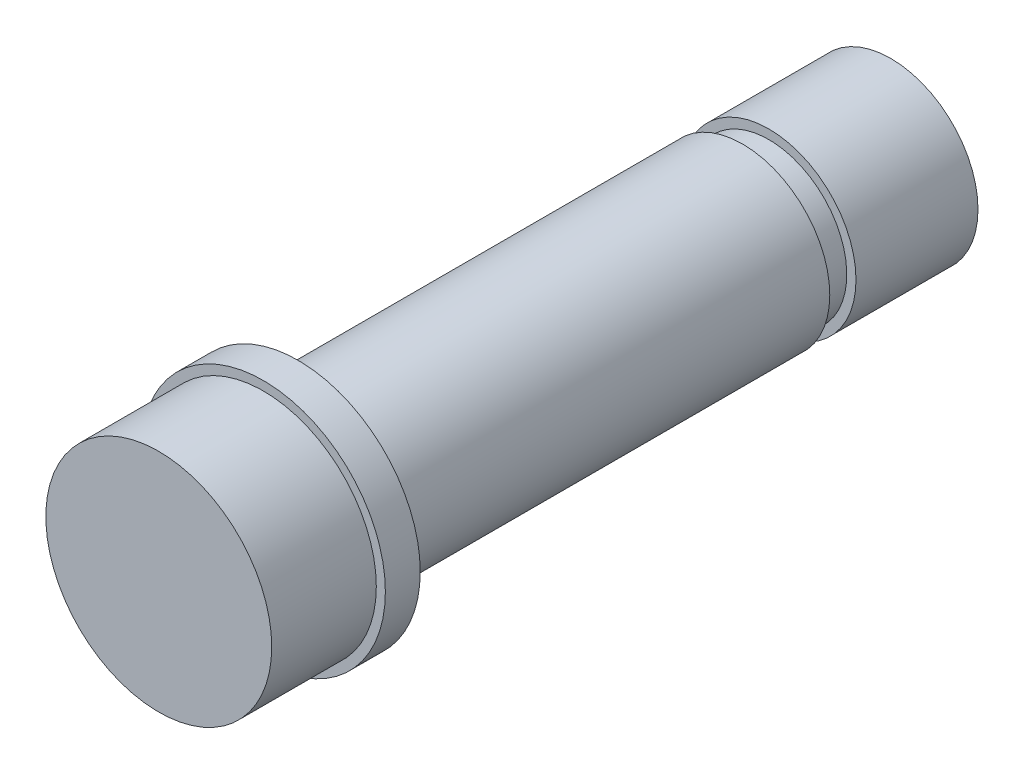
ISO-10303-21;
HEADER;
FILE_DESCRIPTION(('STEP AP214'),'2;1');
FILE_NAME('part.step','',(''),(''),'','','');
FILE_SCHEMA(('AUTOMOTIVE_DESIGN { 1 0 10303 214 1 1 1 1 }'));
ENDSEC;
DATA;
#1=APPLICATION_CONTEXT('core data for automotive mechanical design processes');
#2=APPLICATION_PROTOCOL_DEFINITION('international standard','automotive_design',2000,#1);
#3=PRODUCT_CONTEXT('',#1,'mechanical');
#4=PRODUCT('Part','Part','',(#3));
#5=PRODUCT_RELATED_PRODUCT_CATEGORY('part','',(#4));
#6=PRODUCT_DEFINITION_FORMATION('','',#4);
#7=PRODUCT_DEFINITION_CONTEXT('part definition',#1,'design');
#8=PRODUCT_DEFINITION('design','',#6,#7);
#9=PRODUCT_DEFINITION_SHAPE('','',#8);
#10=(LENGTH_UNIT() NAMED_UNIT(*) SI_UNIT(.MILLI.,.METRE.));
#11=(NAMED_UNIT(*) PLANE_ANGLE_UNIT() SI_UNIT($,.RADIAN.));
#12=(NAMED_UNIT(*) SI_UNIT($,.STERADIAN.) SOLID_ANGLE_UNIT());
#13=UNCERTAINTY_MEASURE_WITH_UNIT(LENGTH_MEASURE(1.E-05),#10,'distance_accuracy_value','');
#14=(GEOMETRIC_REPRESENTATION_CONTEXT(3) GLOBAL_UNCERTAINTY_ASSIGNED_CONTEXT((#13)) GLOBAL_UNIT_ASSIGNED_CONTEXT((#10,
#11,#12)) REPRESENTATION_CONTEXT('',''));
#15=CARTESIAN_POINT('',(0.,0.,0.));
#16=DIRECTION('',(0.,0.,1.));
#17=DIRECTION('',(1.,0.,0.));
#18=AXIS2_PLACEMENT_3D('',#15,#16,#17);
#19=CARTESIAN_POINT('',(0.,0.,0.));
#20=DIRECTION('',(0.,0.,1.));
#21=DIRECTION('',(1.,0.,0.));
#22=AXIS2_PLACEMENT_3D('',#19,#20,#21);
#23=CYLINDRICAL_SURFACE('',#22,7.9375);
#24=CARTESIAN_POINT('',(0.,0.,0.));
#25=DIRECTION('',(0.,0.,1.));
#26=DIRECTION('',(1.,0.,0.));
#27=AXIS2_PLACEMENT_3D('',#24,#25,#26);
#28=CIRCLE('',#27,7.93749999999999);
#29=CARTESIAN_POINT('',(7.93749999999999,0.,0.));
#30=VERTEX_POINT('',#29);
#31=EDGE_CURVE('E110',#30,#30,#28,.T.);
#32=ORIENTED_EDGE('',*,*,#31,.F.);
#33=EDGE_LOOP('',(#32));
#34=FACE_BOUND('',#33,.T.);
#35=CARTESIAN_POINT('',(0.,0.,-40.4749));
#36=DIRECTION('',(0.,0.,1.));
#37=DIRECTION('',(0.,-1.,0.));
#38=AXIS2_PLACEMENT_3D('',#35,#36,#37);
#39=CIRCLE('',#38,7.9375);
#40=CARTESIAN_POINT('',(0.,-7.9375,-40.4749));
#41=VERTEX_POINT('',#40);
#42=EDGE_CURVE('E88',#41,#41,#39,.T.);
#43=ORIENTED_EDGE('',*,*,#42,.T.);
#44=EDGE_LOOP('',(#43));
#45=FACE_BOUND('',#44,.T.);
#46=ADVANCED_FACE('F36',(#34,#45),#23,.T.);
#47=CARTESIAN_POINT('',(0.,7.93749999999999,0.));
#48=DIRECTION('',(0.,0.,1.));
#49=DIRECTION('',(1.,0.,0.));
#50=AXIS2_PLACEMENT_3D('',#47,#48,#49);
#51=PLANE('',#50);
#52=CARTESIAN_POINT('',(0.,0.,0.));
#53=DIRECTION('',(0.,0.,1.));
#54=DIRECTION('',(1.,0.,0.));
#55=AXIS2_PLACEMENT_3D('',#52,#53,#54);
#56=CIRCLE('',#55,11.1125);
#57=CARTESIAN_POINT('',(11.1125,0.,0.));
#58=VERTEX_POINT('',#57);
#59=EDGE_CURVE('E113',#58,#58,#56,.T.);
#60=ORIENTED_EDGE('',*,*,#59,.F.);
#61=EDGE_LOOP('',(#60));
#62=FACE_BOUND('',#61,.T.);
#63=CARTESIAN_POINT('',(0.,0.,0.));
#64=DIRECTION('',(0.,0.,1.));
#65=DIRECTION('',(1.,0.,0.));
#66=AXIS2_PLACEMENT_3D('',#63,#64,#65);
#67=CIRCLE('',#66,10.7188);
#68=CARTESIAN_POINT('',(10.7188,0.,0.));
#69=VERTEX_POINT('',#68);
#70=EDGE_CURVE('E107',#69,#69,#67,.T.);
#71=ORIENTED_EDGE('',*,*,#70,.T.);
#72=EDGE_LOOP('',(#71));
#73=FACE_BOUND('',#72,.T.);
#74=ADVANCED_FACE('F64',(#62,#73),#51,.F.);
#75=CARTESIAN_POINT('',(0.,10.287,12.7));
#76=DIRECTION('',(0.,0.,-1.));
#77=DIRECTION('',(-1.,0.,0.));
#78=AXIS2_PLACEMENT_3D('',#75,#76,#77);
#79=PLANE('',#78);
#80=CARTESIAN_POINT('',(0.,0.,12.7));
#81=DIRECTION('',(0.,0.,1.));
#82=DIRECTION('',(1.,0.,0.));
#83=AXIS2_PLACEMENT_3D('',#80,#81,#82);
#84=CIRCLE('',#83,10.287);
#85=CARTESIAN_POINT('',(10.287,0.,12.7));
#86=VERTEX_POINT('',#85);
#87=EDGE_CURVE('E122',#86,#86,#84,.T.);
#88=ORIENTED_EDGE('',*,*,#87,.T.);
#89=EDGE_LOOP('',(#88));
#90=FACE_BOUND('',#89,.T.);
#91=ADVANCED_FACE('F70',(#90),#79,.F.);
#92=CARTESIAN_POINT('',(0.,0.,0.));
#93=DIRECTION('',(0.,0.,1.));
#94=DIRECTION('',(1.,0.,0.));
#95=AXIS2_PLACEMENT_3D('',#92,#93,#94);
#96=CYLINDRICAL_SURFACE('',#95,10.287);
#97=ORIENTED_EDGE('',*,*,#87,.F.);
#98=EDGE_LOOP('',(#97));
#99=FACE_BOUND('',#98,.T.);
#100=CARTESIAN_POINT('',(0.,0.,3.175));
#101=DIRECTION('',(0.,0.,1.));
#102=DIRECTION('',(1.,0.,0.));
#103=AXIS2_PLACEMENT_3D('',#100,#101,#102);
#104=CIRCLE('',#103,10.287);
#105=CARTESIAN_POINT('',(10.287,0.,3.175));
#106=VERTEX_POINT('',#105);
#107=EDGE_CURVE('E119',#106,#106,#104,.T.);
#108=ORIENTED_EDGE('',*,*,#107,.T.);
#109=EDGE_LOOP('',(#108));
#110=FACE_BOUND('',#109,.T.);
#111=ADVANCED_FACE('F134',(#99,#110),#96,.T.);
#112=CARTESIAN_POINT('',(0.,11.1125,3.175));
#113=DIRECTION('',(0.,0.,-1.));
#114=DIRECTION('',(-1.,0.,0.));
#115=AXIS2_PLACEMENT_3D('',#112,#113,#114);
#116=PLANE('',#115);
#117=ORIENTED_EDGE('',*,*,#107,.F.);
#118=EDGE_LOOP('',(#117));
#119=FACE_BOUND('',#118,.T.);
#120=CARTESIAN_POINT('',(0.,0.,3.175));
#121=DIRECTION('',(0.,0.,1.));
#122=DIRECTION('',(1.,0.,0.));
#123=AXIS2_PLACEMENT_3D('',#120,#121,#122);
#124=CIRCLE('',#123,11.1125);
#125=CARTESIAN_POINT('',(11.1125,0.,3.175));
#126=VERTEX_POINT('',#125);
#127=EDGE_CURVE('E116',#126,#126,#124,.T.);
#128=ORIENTED_EDGE('',*,*,#127,.T.);
#129=EDGE_LOOP('',(#128));
#130=FACE_BOUND('',#129,.T.);
#131=ADVANCED_FACE('F137',(#119,#130),#116,.F.);
#132=CARTESIAN_POINT('',(0.,0.,0.));
#133=DIRECTION('',(0.,0.,1.));
#134=DIRECTION('',(1.,0.,0.));
#135=AXIS2_PLACEMENT_3D('',#132,#133,#134);
#136=CYLINDRICAL_SURFACE('',#135,11.1125);
#137=ORIENTED_EDGE('',*,*,#127,.F.);
#138=EDGE_LOOP('',(#137));
#139=FACE_BOUND('',#138,.T.);
#140=ORIENTED_EDGE('',*,*,#59,.T.);
#141=EDGE_LOOP('',(#140));
#142=FACE_BOUND('',#141,.T.);
#143=ADVANCED_FACE('F143',(#139,#142),#136,.T.);
#144=CARTESIAN_POINT('',(0.,0.,0.));
#145=DIRECTION('',(0.,0.,1.));
#146=DIRECTION('',(1.,0.,0.));
#147=AXIS2_PLACEMENT_3D('',#144,#145,#146);
#148=CYLINDRICAL_SURFACE('',#147,10.7188);
#149=CARTESIAN_POINT('',(0.,0.,1.27));
#150=DIRECTION('',(0.,0.,1.));
#151=DIRECTION('',(1.,0.,0.));
#152=AXIS2_PLACEMENT_3D('',#149,#150,#151);
#153=CIRCLE('',#152,10.7188);
#154=CARTESIAN_POINT('',(10.7188,0.,1.27));
#155=VERTEX_POINT('',#154);
#156=EDGE_CURVE('E104',#155,#155,#153,.T.);
#157=ORIENTED_EDGE('',*,*,#156,.T.);
#158=EDGE_LOOP('',(#157));
#159=FACE_BOUND('',#158,.T.);
#160=ORIENTED_EDGE('',*,*,#70,.F.);
#161=EDGE_LOOP('',(#160));
#162=FACE_BOUND('',#161,.T.);
#163=ADVANCED_FACE('F149',(#159,#162),#148,.F.);
#164=CARTESIAN_POINT('',(0.,8.5852,1.27));
#165=DIRECTION('',(0.,0.,-1.));
#166=DIRECTION('',(-1.,0.,0.));
#167=AXIS2_PLACEMENT_3D('',#164,#165,#166);
#168=PLANE('',#167);
#169=CARTESIAN_POINT('',(0.,0.,1.27));
#170=DIRECTION('',(0.,0.,1.));
#171=DIRECTION('',(1.,0.,0.));
#172=AXIS2_PLACEMENT_3D('',#169,#170,#171);
#173=CIRCLE('',#172,8.5852);
#174=CARTESIAN_POINT('',(8.5852,0.,1.27));
#175=VERTEX_POINT('',#174);
#176=EDGE_CURVE('E101',#175,#175,#173,.T.);
#177=ORIENTED_EDGE('',*,*,#176,.T.);
#178=EDGE_LOOP('',(#177));
#179=FACE_BOUND('',#178,.T.);
#180=ORIENTED_EDGE('',*,*,#156,.F.);
#181=EDGE_LOOP('',(#180));
#182=FACE_BOUND('',#181,.T.);
#183=ADVANCED_FACE('F156',(#179,#182),#168,.T.);
#184=CARTESIAN_POINT('',(0.,0.,0.));
#185=DIRECTION('',(0.,0.,1.));
#186=DIRECTION('',(1.,0.,0.));
#187=AXIS2_PLACEMENT_3D('',#184,#185,#186);
#188=CYLINDRICAL_SURFACE('',#187,8.5852);
#189=CARTESIAN_POINT('',(0.,0.,0.));
#190=DIRECTION('',(0.,0.,1.));
#191=DIRECTION('',(1.,0.,0.));
#192=AXIS2_PLACEMENT_3D('',#189,#190,#191);
#193=CIRCLE('',#192,8.5852);
#194=CARTESIAN_POINT('',(8.5852,0.,0.));
#195=VERTEX_POINT('',#194);
#196=EDGE_CURVE('E98',#195,#195,#193,.T.);
#197=ORIENTED_EDGE('',*,*,#196,.T.);
#198=EDGE_LOOP('',(#197));
#199=FACE_BOUND('',#198,.T.);
#200=ORIENTED_EDGE('',*,*,#176,.F.);
#201=EDGE_LOOP('',(#200));
#202=FACE_BOUND('',#201,.T.);
#203=ADVANCED_FACE('F162',(#199,#202),#188,.T.);
#204=ORIENTED_EDGE('',*,*,#31,.T.);
#205=EDGE_LOOP('',(#204));
#206=FACE_BOUND('',#205,.T.);
#207=ORIENTED_EDGE('',*,*,#196,.F.);
#208=EDGE_LOOP('',(#207));
#209=FACE_BOUND('',#208,.T.);
#210=ADVANCED_FACE('F73',(#206,#209),#51,.F.);
#211=CARTESIAN_POINT('',(0.,7.9375,-40.4749));
#212=DIRECTION('',(0.,0.,-1.));
#213=DIRECTION('',(0.,1.,0.));
#214=AXIS2_PLACEMENT_3D('',#211,#212,#213);
#215=PLANE('',#214);
#216=CARTESIAN_POINT('',(0.,0.,-40.4749));
#217=DIRECTION('',(0.,0.,1.));
#218=DIRECTION('',(0.,-1.,0.));
#219=AXIS2_PLACEMENT_3D('',#216,#217,#218);
#220=CIRCLE('',#219,7.09803);
#221=CARTESIAN_POINT('',(0.,-7.09803,-40.4749));
#222=VERTEX_POINT('',#221);
#223=EDGE_CURVE('E91',#222,#222,#220,.T.);
#224=ORIENTED_EDGE('',*,*,#223,.T.);
#225=EDGE_LOOP('',(#224));
#226=FACE_BOUND('',#225,.T.);
#227=ORIENTED_EDGE('',*,*,#42,.F.);
#228=EDGE_LOOP('',(#227));
#229=FACE_BOUND('',#228,.T.);
#230=ADVANCED_FACE('F215',(#226,#229),#215,.T.);
#231=CARTESIAN_POINT('',(0.,0.,0.));
#232=DIRECTION('',(0.,0.,1.));
#233=DIRECTION('',(0.,-1.,0.));
#234=AXIS2_PLACEMENT_3D('',#231,#232,#233);
#235=CYLINDRICAL_SURFACE('',#234,7.09803);
#236=CARTESIAN_POINT('',(0.,0.,-42.8625));
#237=DIRECTION('',(0.,0.,1.));
#238=DIRECTION('',(0.,-1.,0.));
#239=AXIS2_PLACEMENT_3D('',#236,#237,#238);
#240=CIRCLE('',#239,7.09803);
#241=CARTESIAN_POINT('',(0.,-7.09803,-42.8625));
#242=VERTEX_POINT('',#241);
#243=EDGE_CURVE('E87',#242,#242,#240,.T.);
#244=ORIENTED_EDGE('',*,*,#243,.T.);
#245=EDGE_LOOP('',(#244));
#246=FACE_BOUND('',#245,.T.);
#247=ORIENTED_EDGE('',*,*,#223,.F.);
#248=EDGE_LOOP('',(#247));
#249=FACE_BOUND('',#248,.T.);
#250=ADVANCED_FACE('F58',(#246,#249),#235,.T.);
#251=CARTESIAN_POINT('',(0.,7.9375,-42.8625));
#252=DIRECTION('',(0.,0.,1.));
#253=DIRECTION('',(0.,-1.,0.));
#254=AXIS2_PLACEMENT_3D('',#251,#252,#253);
#255=PLANE('',#254);
#256=CARTESIAN_POINT('',(0.,0.,-42.8625));
#257=DIRECTION('',(0.,0.,1.));
#258=DIRECTION('',(0.,-1.,0.));
#259=AXIS2_PLACEMENT_3D('',#256,#257,#258);
#260=CIRCLE('',#259,7.9375);
#261=CARTESIAN_POINT('',(0.,-7.9375,-42.8625));
#262=VERTEX_POINT('',#261);
#263=EDGE_CURVE('E86',#262,#262,#260,.T.);
#264=ORIENTED_EDGE('',*,*,#263,.T.);
#265=EDGE_LOOP('',(#264));
#266=FACE_BOUND('',#265,.T.);
#267=ORIENTED_EDGE('',*,*,#243,.F.);
#268=EDGE_LOOP('',(#267));
#269=FACE_BOUND('',#268,.T.);
#270=ADVANCED_FACE('F48',(#266,#269),#255,.T.);
#271=CARTESIAN_POINT('',(0.,0.,6.82855884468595));
#272=DIRECTION('',(0.,0.,-1.));
#273=DIRECTION('',(-1.,0.,0.));
#274=AXIS2_PLACEMENT_3D('',#271,#272,#273);
#275=CONICAL_SURFACE('',#274,0.,1.0471975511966);
#276=CARTESIAN_POINT('',(0.,0.,3.048));
#277=DIRECTION('',(0.,0.,1.));
#278=DIRECTION('',(1.,0.,0.));
#279=AXIS2_PLACEMENT_3D('',#276,#277,#278);
#280=CIRCLE('',#279,6.54812);
#281=CARTESIAN_POINT('',(6.54812,0.,3.048));
#282=VERTEX_POINT('',#281);
#283=EDGE_CURVE('E125',#282,#282,#280,.T.);
#284=ORIENTED_EDGE('',*,*,#283,.F.);
#285=EDGE_LOOP('',(#284));
#286=FACE_BOUND('',#285,.T.);
#287=CARTESIAN_POINT('',(0.,0.,6.82855884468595));
#288=VERTEX_POINT('',#287);
#289=VERTEX_LOOP('',#288);
#290=FACE_BOUND('',#289,.T.);
#291=ADVANCED_FACE('F45',(#286,#290),#275,.F.);
#292=CARTESIAN_POINT('',(0.,0.,0.));
#293=DIRECTION('',(0.,0.,1.));
#294=DIRECTION('',(1.,0.,0.));
#295=AXIS2_PLACEMENT_3D('',#292,#293,#294);
#296=CYLINDRICAL_SURFACE('',#295,6.54812);
#297=CARTESIAN_POINT('',(0.,0.,-53.975));
#298=DIRECTION('',(0.,0.,1.));
#299=DIRECTION('',(1.,0.,0.));
#300=AXIS2_PLACEMENT_3D('',#297,#298,#299);
#301=CIRCLE('',#300,6.54812);
#302=CARTESIAN_POINT('',(6.54812,0.,-53.975));
#303=VERTEX_POINT('',#302);
#304=EDGE_CURVE('E42',#303,#303,#301,.T.);
#305=ORIENTED_EDGE('',*,*,#304,.F.);
#306=EDGE_LOOP('',(#305));
#307=FACE_BOUND('',#306,.T.);
#308=ORIENTED_EDGE('',*,*,#283,.T.);
#309=EDGE_LOOP('',(#308));
#310=FACE_BOUND('',#309,.T.);
#311=ADVANCED_FACE('F47',(#307,#310),#296,.F.);
#312=CARTESIAN_POINT('',(0.,6.54812,-53.975));
#313=DIRECTION('',(0.,0.,1.));
#314=DIRECTION('',(1.,0.,0.));
#315=AXIS2_PLACEMENT_3D('',#312,#313,#314);
#316=PLANE('',#315);
#317=CARTESIAN_POINT('',(0.,0.,-53.975));
#318=DIRECTION('',(0.,0.,1.));
#319=DIRECTION('',(1.,0.,0.));
#320=AXIS2_PLACEMENT_3D('',#317,#318,#319);
#321=CIRCLE('',#320,7.9375);
#322=CARTESIAN_POINT('',(7.9375,0.,-53.975));
#323=VERTEX_POINT('',#322);
#324=EDGE_CURVE('E11',#323,#323,#321,.T.);
#325=ORIENTED_EDGE('',*,*,#324,.F.);
#326=EDGE_LOOP('',(#325));
#327=FACE_BOUND('',#326,.T.);
#328=ORIENTED_EDGE('',*,*,#304,.T.);
#329=EDGE_LOOP('',(#328));
#330=FACE_BOUND('',#329,.T.);
#331=ADVANCED_FACE('F55',(#327,#330),#316,.F.);
#332=ORIENTED_EDGE('',*,*,#324,.T.);
#333=EDGE_LOOP('',(#332));
#334=FACE_BOUND('',#333,.T.);
#335=ORIENTED_EDGE('',*,*,#263,.F.);
#336=EDGE_LOOP('',(#335));
#337=FACE_BOUND('',#336,.T.);
#338=ADVANCED_FACE('F66',(#334,#337),#23,.T.);
#339=CLOSED_SHELL('',(#46,#74,#91,#111,#131,#143,#163,#183,#203,#210,#230,#250,#270,#291,#311,
#331,#338));
#340=MANIFOLD_SOLID_BREP('B2',#339);
#341=ADVANCED_BREP_SHAPE_REPRESENTATION('',(#18,#340),#14);
#342=SHAPE_DEFINITION_REPRESENTATION(#9,#341);
ENDSEC;
END-ISO-10303-21;
